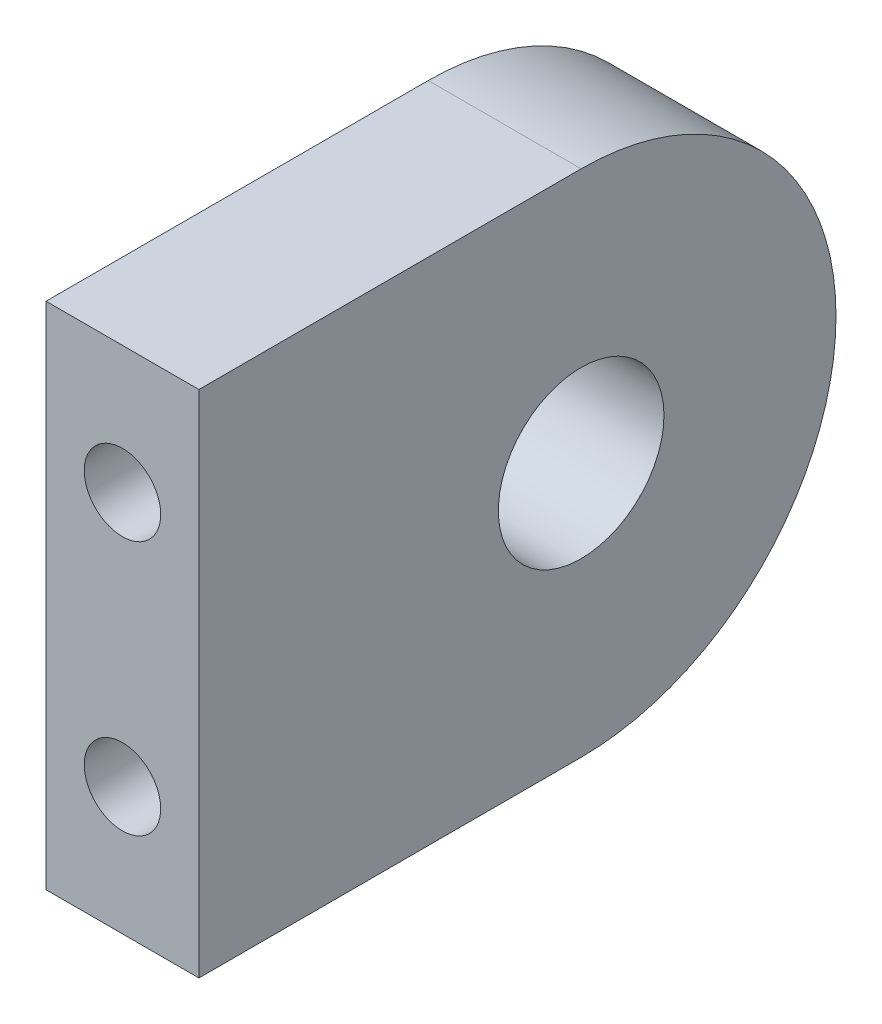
ISO-10303-21;
HEADER;
FILE_DESCRIPTION(('STEP AP214'),'2;1');
FILE_NAME('part.step','',(''),(''),'','','');
FILE_SCHEMA(('AUTOMOTIVE_DESIGN { 1 0 10303 214 1 1 1 1 }'));
ENDSEC;
DATA;
#1=APPLICATION_CONTEXT('core data for automotive mechanical design processes');
#2=APPLICATION_PROTOCOL_DEFINITION('international standard','automotive_design',2000,#1);
#3=PRODUCT_CONTEXT('',#1,'mechanical');
#4=PRODUCT('Part','Part','',(#3));
#5=PRODUCT_RELATED_PRODUCT_CATEGORY('part','',(#4));
#6=PRODUCT_DEFINITION_FORMATION('','',#4);
#7=PRODUCT_DEFINITION_CONTEXT('part definition',#1,'design');
#8=PRODUCT_DEFINITION('design','',#6,#7);
#9=PRODUCT_DEFINITION_SHAPE('','',#8);
#10=(LENGTH_UNIT() NAMED_UNIT(*) SI_UNIT(.MILLI.,.METRE.));
#11=(NAMED_UNIT(*) PLANE_ANGLE_UNIT() SI_UNIT($,.RADIAN.));
#12=(NAMED_UNIT(*) SI_UNIT($,.STERADIAN.) SOLID_ANGLE_UNIT());
#13=UNCERTAINTY_MEASURE_WITH_UNIT(LENGTH_MEASURE(1.E-05),#10,'distance_accuracy_value','');
#14=(GEOMETRIC_REPRESENTATION_CONTEXT(3) GLOBAL_UNCERTAINTY_ASSIGNED_CONTEXT((#13)) GLOBAL_UNIT_ASSIGNED_CONTEXT((#10,
#11,#12)) REPRESENTATION_CONTEXT('',''));
#15=CARTESIAN_POINT('',(0.,0.,0.));
#16=DIRECTION('',(0.,0.,1.));
#17=DIRECTION('',(1.,0.,0.));
#18=AXIS2_PLACEMENT_3D('',#15,#16,#17);
#19=CARTESIAN_POINT('',(6.,10.,-15.));
#20=DIRECTION('',(1.,0.,0.));
#21=DIRECTION('',(0.,0.,-1.));
#22=AXIS2_PLACEMENT_3D('',#19,#20,#21);
#23=PLANE('',#22);
#24=DIRECTION('',(0.,-1.,0.));
#25=VECTOR('',#24,1.);
#26=CARTESIAN_POINT('',(6.,0.,0.));
#27=LINE('',#26,#25);
#28=CARTESIAN_POINT('',(6.,20.,0.));
#29=VERTEX_POINT('',#28);
#30=CARTESIAN_POINT('',(6.,0.,0.));
#31=VERTEX_POINT('',#30);
#32=EDGE_CURVE('E123',#29,#31,#27,.T.);
#33=ORIENTED_EDGE('',*,*,#32,.T.);
#34=DIRECTION('',(0.,0.,-1.));
#35=VECTOR('',#34,1.);
#36=CARTESIAN_POINT('',(6.,0.,0.));
#37=LINE('',#36,#35);
#38=CARTESIAN_POINT('',(6.,0.,-15.));
#39=VERTEX_POINT('',#38);
#40=EDGE_CURVE('E80',#31,#39,#37,.T.);
#41=ORIENTED_EDGE('',*,*,#40,.T.);
#42=CARTESIAN_POINT('',(6.,10.,-15.));
#43=DIRECTION('',(1.,0.,0.));
#44=DIRECTION('',(0.,0.,-1.));
#45=AXIS2_PLACEMENT_3D('',#42,#43,#44);
#46=CIRCLE('',#45,10.);
#47=CARTESIAN_POINT('',(6.,20.,-15.));
#48=VERTEX_POINT('',#47);
#49=EDGE_CURVE('E126',#39,#48,#46,.T.);
#50=ORIENTED_EDGE('',*,*,#49,.T.);
#51=DIRECTION('',(0.,0.,1.));
#52=VECTOR('',#51,1.);
#53=CARTESIAN_POINT('',(6.,20.,0.));
#54=LINE('',#53,#52);
#55=EDGE_CURVE('E49',#48,#29,#54,.T.);
#56=ORIENTED_EDGE('',*,*,#55,.T.);
#57=EDGE_LOOP('',(#33,#41,#50,#56));
#58=FACE_BOUND('',#57,.T.);
#59=CARTESIAN_POINT('',(6.,10.,-15.));
#60=DIRECTION('',(1.,0.,0.));
#61=DIRECTION('',(0.,0.,-1.));
#62=AXIS2_PLACEMENT_3D('',#59,#60,#61);
#63=CIRCLE('',#62,3.25);
#64=CARTESIAN_POINT('',(6.,10.,-18.25));
#65=VERTEX_POINT('',#64);
#66=EDGE_CURVE('E117',#65,#65,#63,.T.);
#67=ORIENTED_EDGE('',*,*,#66,.F.);
#68=EDGE_LOOP('',(#67));
#69=FACE_BOUND('',#68,.T.);
#70=ADVANCED_FACE('F32',(#58,#69),#23,.T.);
#71=CARTESIAN_POINT('',(0.,10.,-15.));
#72=DIRECTION('',(1.,0.,0.));
#73=DIRECTION('',(0.,0.,-1.));
#74=AXIS2_PLACEMENT_3D('',#71,#72,#73);
#75=PLANE('',#74);
#76=DIRECTION('',(0.,-1.,0.));
#77=VECTOR('',#76,1.);
#78=CARTESIAN_POINT('',(0.,0.,0.));
#79=LINE('',#78,#77);
#80=CARTESIAN_POINT('',(0.,20.,0.));
#81=VERTEX_POINT('',#80);
#82=CARTESIAN_POINT('',(0.,0.,0.));
#83=VERTEX_POINT('',#82);
#84=EDGE_CURVE('E120',#81,#83,#79,.T.);
#85=ORIENTED_EDGE('',*,*,#84,.F.);
#86=DIRECTION('',(0.,0.,1.));
#87=VECTOR('',#86,1.);
#88=CARTESIAN_POINT('',(0.,20.,0.));
#89=LINE('',#88,#87);
#90=CARTESIAN_POINT('',(0.,20.,-15.));
#91=VERTEX_POINT('',#90);
#92=EDGE_CURVE('E73',#91,#81,#89,.T.);
#93=ORIENTED_EDGE('',*,*,#92,.F.);
#94=CARTESIAN_POINT('',(0.,10.,-15.));
#95=DIRECTION('',(1.,0.,0.));
#96=DIRECTION('',(0.,0.,-1.));
#97=AXIS2_PLACEMENT_3D('',#94,#95,#96);
#98=CIRCLE('',#97,10.);
#99=CARTESIAN_POINT('',(0.,0.,-15.));
#100=VERTEX_POINT('',#99);
#101=EDGE_CURVE('E67',#100,#91,#98,.T.);
#102=ORIENTED_EDGE('',*,*,#101,.F.);
#103=DIRECTION('',(0.,0.,-1.));
#104=VECTOR('',#103,1.);
#105=CARTESIAN_POINT('',(0.,0.,0.));
#106=LINE('',#105,#104);
#107=EDGE_CURVE('E132',#83,#100,#106,.T.);
#108=ORIENTED_EDGE('',*,*,#107,.F.);
#109=EDGE_LOOP('',(#85,#93,#102,#108));
#110=FACE_BOUND('',#109,.T.);
#111=CARTESIAN_POINT('',(0.,10.,-15.));
#112=DIRECTION('',(1.,0.,0.));
#113=DIRECTION('',(0.,0.,-1.));
#114=AXIS2_PLACEMENT_3D('',#111,#112,#113);
#115=CIRCLE('',#114,3.25);
#116=CARTESIAN_POINT('',(0.,10.,-18.25));
#117=VERTEX_POINT('',#116);
#118=EDGE_CURVE('E116',#117,#117,#115,.T.);
#119=ORIENTED_EDGE('',*,*,#118,.T.);
#120=EDGE_LOOP('',(#119));
#121=FACE_BOUND('',#120,.T.);
#122=ADVANCED_FACE('F142',(#110,#121),#75,.F.);
#123=CARTESIAN_POINT('',(6.,0.,0.));
#124=DIRECTION('',(0.,0.,-1.));
#125=DIRECTION('',(0.,1.,0.));
#126=AXIS2_PLACEMENT_3D('',#123,#124,#125);
#127=PLANE('',#126);
#128=CARTESIAN_POINT('',(3.,15.,0.));
#129=DIRECTION('',(0.,0.,1.));
#130=DIRECTION('',(0.,-1.,0.));
#131=AXIS2_PLACEMENT_3D('',#128,#129,#130);
#132=CIRCLE('',#131,1.49999999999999);
#133=CARTESIAN_POINT('',(3.,13.5,0.));
#134=VERTEX_POINT('',#133);
#135=EDGE_CURVE('E198',#134,#134,#132,.T.);
#136=ORIENTED_EDGE('',*,*,#135,.F.);
#137=EDGE_LOOP('',(#136));
#138=FACE_BOUND('',#137,.T.);
#139=CARTESIAN_POINT('',(3.,5.,0.));
#140=DIRECTION('',(0.,0.,1.));
#141=DIRECTION('',(0.,-1.,0.));
#142=AXIS2_PLACEMENT_3D('',#139,#140,#141);
#143=CIRCLE('',#142,1.49999999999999);
#144=CARTESIAN_POINT('',(3.,3.5,0.));
#145=VERTEX_POINT('',#144);
#146=EDGE_CURVE('E97',#145,#145,#143,.T.);
#147=ORIENTED_EDGE('',*,*,#146,.F.);
#148=EDGE_LOOP('',(#147));
#149=FACE_BOUND('',#148,.T.);
#150=ORIENTED_EDGE('',*,*,#84,.T.);
#151=DIRECTION('',(-1.,0.,0.));
#152=VECTOR('',#151,1.);
#153=CARTESIAN_POINT('',(6.,0.,0.));
#154=LINE('',#153,#152);
#155=EDGE_CURVE('E11',#31,#83,#154,.T.);
#156=ORIENTED_EDGE('',*,*,#155,.F.);
#157=ORIENTED_EDGE('',*,*,#32,.F.);
#158=DIRECTION('',(-1.,0.,0.));
#159=VECTOR('',#158,1.);
#160=CARTESIAN_POINT('',(6.,20.,0.));
#161=LINE('',#160,#159);
#162=EDGE_CURVE('E129',#29,#81,#161,.T.);
#163=ORIENTED_EDGE('',*,*,#162,.T.);
#164=EDGE_LOOP('',(#150,#156,#157,#163));
#165=FACE_BOUND('',#164,.T.);
#166=ADVANCED_FACE('F34',(#138,#149,#165),#127,.F.);
#167=CARTESIAN_POINT('',(6.,0.,0.));
#168=DIRECTION('',(0.,1.,0.));
#169=DIRECTION('',(0.,0.,1.));
#170=AXIS2_PLACEMENT_3D('',#167,#168,#169);
#171=PLANE('',#170);
#172=ORIENTED_EDGE('',*,*,#107,.T.);
#173=DIRECTION('',(-1.,0.,0.));
#174=VECTOR('',#173,1.);
#175=CARTESIAN_POINT('',(6.,0.,-15.));
#176=LINE('',#175,#174);
#177=EDGE_CURVE('E41',#39,#100,#176,.T.);
#178=ORIENTED_EDGE('',*,*,#177,.F.);
#179=ORIENTED_EDGE('',*,*,#40,.F.);
#180=ORIENTED_EDGE('',*,*,#155,.T.);
#181=EDGE_LOOP('',(#172,#178,#179,#180));
#182=FACE_BOUND('',#181,.T.);
#183=ADVANCED_FACE('F158',(#182),#171,.F.);
#184=CARTESIAN_POINT('',(6.,10.,-15.));
#185=DIRECTION('',(-1.,0.,0.));
#186=DIRECTION('',(0.,0.,1.));
#187=AXIS2_PLACEMENT_3D('',#184,#185,#186);
#188=CYLINDRICAL_SURFACE('',#187,10.);
#189=ORIENTED_EDGE('',*,*,#101,.T.);
#190=DIRECTION('',(-1.,0.,0.));
#191=VECTOR('',#190,1.);
#192=CARTESIAN_POINT('',(6.,20.,-15.));
#193=LINE('',#192,#191);
#194=EDGE_CURVE('E137',#48,#91,#193,.T.);
#195=ORIENTED_EDGE('',*,*,#194,.F.);
#196=ORIENTED_EDGE('',*,*,#49,.F.);
#197=ORIENTED_EDGE('',*,*,#177,.T.);
#198=EDGE_LOOP('',(#189,#195,#196,#197));
#199=FACE_BOUND('',#198,.T.);
#200=ADVANCED_FACE('F139',(#199),#188,.T.);
#201=CARTESIAN_POINT('',(6.,20.,0.));
#202=DIRECTION('',(0.,-1.,0.));
#203=DIRECTION('',(0.,0.,-1.));
#204=AXIS2_PLACEMENT_3D('',#201,#202,#203);
#205=PLANE('',#204);
#206=ORIENTED_EDGE('',*,*,#92,.T.);
#207=ORIENTED_EDGE('',*,*,#162,.F.);
#208=ORIENTED_EDGE('',*,*,#55,.F.);
#209=ORIENTED_EDGE('',*,*,#194,.T.);
#210=EDGE_LOOP('',(#206,#207,#208,#209));
#211=FACE_BOUND('',#210,.T.);
#212=ADVANCED_FACE('F147',(#211),#205,.F.);
#213=CARTESIAN_POINT('',(6.,10.,-15.));
#214=DIRECTION('',(-1.,0.,0.));
#215=DIRECTION('',(0.,0.,1.));
#216=AXIS2_PLACEMENT_3D('',#213,#214,#215);
#217=CYLINDRICAL_SURFACE('',#216,3.25);
#218=ORIENTED_EDGE('',*,*,#66,.T.);
#219=EDGE_LOOP('',(#218));
#220=FACE_BOUND('',#219,.T.);
#221=ORIENTED_EDGE('',*,*,#118,.F.);
#222=EDGE_LOOP('',(#221));
#223=FACE_BOUND('',#222,.T.);
#224=ADVANCED_FACE('F149',(#220,#223),#217,.F.);
#225=CARTESIAN_POINT('',(3.,5.,-9.99999999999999));
#226=DIRECTION('',(0.,0.,1.));
#227=DIRECTION('',(0.,-1.,0.));
#228=AXIS2_PLACEMENT_3D('',#225,#226,#227);
#229=CONICAL_SURFACE('',#228,1.25,1.02974425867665);
#230=CARTESIAN_POINT('',(3.,5.,-10.7510757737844));
#231=VERTEX_POINT('',#230);
#232=VERTEX_LOOP('',#231);
#233=FACE_BOUND('',#232,.T.);
#234=CARTESIAN_POINT('',(3.,5.,-9.99999999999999));
#235=DIRECTION('',(0.,0.,1.));
#236=DIRECTION('',(0.,-1.,0.));
#237=AXIS2_PLACEMENT_3D('',#234,#235,#236);
#238=CIRCLE('',#237,1.25);
#239=CARTESIAN_POINT('',(3.,3.75,-9.99999999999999));
#240=VERTEX_POINT('',#239);
#241=EDGE_CURVE('E113',#240,#240,#238,.T.);
#242=ORIENTED_EDGE('',*,*,#241,.T.);
#243=EDGE_LOOP('',(#242));
#244=FACE_BOUND('',#243,.T.);
#245=ADVANCED_FACE('F155',(#233,#244),#229,.F.);
#246=CARTESIAN_POINT('',(3.,5.,0.));
#247=DIRECTION('',(0.,0.,1.));
#248=DIRECTION('',(0.,-1.,0.));
#249=AXIS2_PLACEMENT_3D('',#246,#247,#248);
#250=CYLINDRICAL_SURFACE('',#249,1.25);
#251=ORIENTED_EDGE('',*,*,#241,.F.);
#252=EDGE_LOOP('',(#251));
#253=FACE_BOUND('',#252,.T.);
#254=CARTESIAN_POINT('',(3.,5.,-6.));
#255=DIRECTION('',(0.,0.,1.));
#256=DIRECTION('',(0.,-1.,0.));
#257=AXIS2_PLACEMENT_3D('',#254,#255,#256);
#258=CIRCLE('',#257,1.25);
#259=CARTESIAN_POINT('',(3.,3.75,-6.));
#260=VERTEX_POINT('',#259);
#261=EDGE_CURVE('E110',#260,#260,#258,.T.);
#262=ORIENTED_EDGE('',*,*,#261,.T.);
#263=EDGE_LOOP('',(#262));
#264=FACE_BOUND('',#263,.T.);
#265=ADVANCED_FACE('F170',(#253,#264),#250,.F.);
#266=CARTESIAN_POINT('',(4.25,5.,-6.));
#267=DIRECTION('',(0.,0.,-1.));
#268=DIRECTION('',(0.,1.,0.));
#269=AXIS2_PLACEMENT_3D('',#266,#267,#268);
#270=PLANE('',#269);
#271=ORIENTED_EDGE('',*,*,#261,.F.);
#272=EDGE_LOOP('',(#271));
#273=FACE_BOUND('',#272,.T.);
#274=CARTESIAN_POINT('',(3.,5.,-6.));
#275=DIRECTION('',(0.,0.,1.));
#276=DIRECTION('',(0.,-1.,0.));
#277=AXIS2_PLACEMENT_3D('',#274,#275,#276);
#278=CIRCLE('',#277,1.5);
#279=CARTESIAN_POINT('',(3.,3.5,-6.));
#280=VERTEX_POINT('',#279);
#281=EDGE_CURVE('E101',#280,#280,#278,.T.);
#282=ORIENTED_EDGE('',*,*,#281,.T.);
#283=EDGE_LOOP('',(#282));
#284=FACE_BOUND('',#283,.T.);
#285=ADVANCED_FACE('F174',(#273,#284),#270,.F.);
#286=CARTESIAN_POINT('',(3.,5.,0.));
#287=DIRECTION('',(0.,0.,1.));
#288=DIRECTION('',(0.,-1.,0.));
#289=AXIS2_PLACEMENT_3D('',#286,#287,#288);
#290=CYLINDRICAL_SURFACE('',#289,1.49999999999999);
#291=ORIENTED_EDGE('',*,*,#281,.F.);
#292=EDGE_LOOP('',(#291));
#293=FACE_BOUND('',#292,.T.);
#294=ORIENTED_EDGE('',*,*,#146,.T.);
#295=EDGE_LOOP('',(#294));
#296=FACE_BOUND('',#295,.T.);
#297=ADVANCED_FACE('F91',(#293,#296),#290,.F.);
#298=CARTESIAN_POINT('',(3.,15.,-9.99999999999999));
#299=DIRECTION('',(0.,0.,1.));
#300=DIRECTION('',(0.,-1.,0.));
#301=AXIS2_PLACEMENT_3D('',#298,#299,#300);
#302=CONICAL_SURFACE('',#301,1.25,1.02974425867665);
#303=CARTESIAN_POINT('',(3.,15.,-10.7510757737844));
#304=VERTEX_POINT('',#303);
#305=VERTEX_LOOP('',#304);
#306=FACE_BOUND('',#305,.T.);
#307=CARTESIAN_POINT('',(3.,15.,-9.99999999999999));
#308=DIRECTION('',(0.,0.,1.));
#309=DIRECTION('',(0.,-1.,0.));
#310=AXIS2_PLACEMENT_3D('',#307,#308,#309);
#311=CIRCLE('',#310,1.25);
#312=CARTESIAN_POINT('',(3.,13.75,-9.99999999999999));
#313=VERTEX_POINT('',#312);
#314=EDGE_CURVE('E95',#313,#313,#311,.T.);
#315=ORIENTED_EDGE('',*,*,#314,.T.);
#316=EDGE_LOOP('',(#315));
#317=FACE_BOUND('',#316,.T.);
#318=ADVANCED_FACE('F87',(#306,#317),#302,.F.);
#319=CARTESIAN_POINT('',(3.,15.,0.));
#320=DIRECTION('',(0.,0.,1.));
#321=DIRECTION('',(0.,-1.,0.));
#322=AXIS2_PLACEMENT_3D('',#319,#320,#321);
#323=CYLINDRICAL_SURFACE('',#322,1.25);
#324=ORIENTED_EDGE('',*,*,#314,.F.);
#325=EDGE_LOOP('',(#324));
#326=FACE_BOUND('',#325,.T.);
#327=CARTESIAN_POINT('',(3.,15.,-6.));
#328=DIRECTION('',(0.,0.,1.));
#329=DIRECTION('',(0.,-1.,0.));
#330=AXIS2_PLACEMENT_3D('',#327,#328,#329);
#331=CIRCLE('',#330,1.25);
#332=CARTESIAN_POINT('',(3.,13.75,-6.));
#333=VERTEX_POINT('',#332);
#334=EDGE_CURVE('E98',#333,#333,#331,.T.);
#335=ORIENTED_EDGE('',*,*,#334,.T.);
#336=EDGE_LOOP('',(#335));
#337=FACE_BOUND('',#336,.T.);
#338=ADVANCED_FACE('F90',(#326,#337),#323,.F.);
#339=CARTESIAN_POINT('',(4.25,15.,-6.));
#340=DIRECTION('',(0.,0.,-1.));
#341=DIRECTION('',(0.,1.,0.));
#342=AXIS2_PLACEMENT_3D('',#339,#340,#341);
#343=PLANE('',#342);
#344=ORIENTED_EDGE('',*,*,#334,.F.);
#345=EDGE_LOOP('',(#344));
#346=FACE_BOUND('',#345,.T.);
#347=CARTESIAN_POINT('',(3.,15.,-6.));
#348=DIRECTION('',(0.,0.,1.));
#349=DIRECTION('',(0.,-1.,0.));
#350=AXIS2_PLACEMENT_3D('',#347,#348,#349);
#351=CIRCLE('',#350,1.49999999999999);
#352=CARTESIAN_POINT('',(3.,13.5,-6.));
#353=VERTEX_POINT('',#352);
#354=EDGE_CURVE('E104',#353,#353,#351,.T.);
#355=ORIENTED_EDGE('',*,*,#354,.T.);
#356=EDGE_LOOP('',(#355));
#357=FACE_BOUND('',#356,.T.);
#358=ADVANCED_FACE('F184',(#346,#357),#343,.F.);
#359=CARTESIAN_POINT('',(3.,15.,0.));
#360=DIRECTION('',(0.,0.,1.));
#361=DIRECTION('',(0.,-1.,0.));
#362=AXIS2_PLACEMENT_3D('',#359,#360,#361);
#363=CYLINDRICAL_SURFACE('',#362,1.49999999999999);
#364=ORIENTED_EDGE('',*,*,#354,.F.);
#365=EDGE_LOOP('',(#364));
#366=FACE_BOUND('',#365,.T.);
#367=ORIENTED_EDGE('',*,*,#135,.T.);
#368=EDGE_LOOP('',(#367));
#369=FACE_BOUND('',#368,.T.);
#370=ADVANCED_FACE('F187',(#366,#369),#363,.F.);
#371=CLOSED_SHELL('',(#70,#122,#166,#183,#200,#212,#224,#245,#265,#285,#297,#318,#338,#358,#370));
#372=MANIFOLD_SOLID_BREP('B2',#371);
#373=ADVANCED_BREP_SHAPE_REPRESENTATION('',(#18,#372),#14);
#374=SHAPE_DEFINITION_REPRESENTATION(#9,#373);
ENDSEC;
END-ISO-10303-21;
